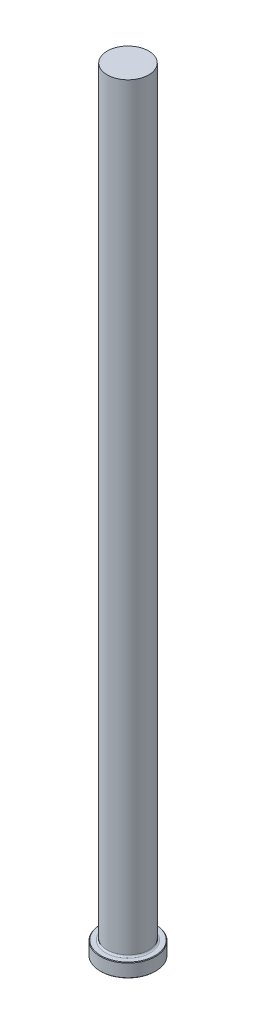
ISO-10303-21;
HEADER;
FILE_DESCRIPTION(('STEP AP214'),'2;1');
FILE_NAME('part.step','',(''),(''),'','','');
FILE_SCHEMA(('AUTOMOTIVE_DESIGN { 1 0 10303 214 1 1 1 1 }'));
ENDSEC;
DATA;
#1=APPLICATION_CONTEXT('core data for automotive mechanical design processes');
#2=APPLICATION_PROTOCOL_DEFINITION('international standard','automotive_design',2000,#1);
#3=PRODUCT_CONTEXT('',#1,'mechanical');
#4=PRODUCT('Part','Part','',(#3));
#5=PRODUCT_RELATED_PRODUCT_CATEGORY('part','',(#4));
#6=PRODUCT_DEFINITION_FORMATION('','',#4);
#7=PRODUCT_DEFINITION_CONTEXT('part definition',#1,'design');
#8=PRODUCT_DEFINITION('design','',#6,#7);
#9=PRODUCT_DEFINITION_SHAPE('','',#8);
#10=(LENGTH_UNIT() NAMED_UNIT(*) SI_UNIT(.MILLI.,.METRE.));
#11=(NAMED_UNIT(*) PLANE_ANGLE_UNIT() SI_UNIT($,.RADIAN.));
#12=(NAMED_UNIT(*) SI_UNIT($,.STERADIAN.) SOLID_ANGLE_UNIT());
#13=UNCERTAINTY_MEASURE_WITH_UNIT(LENGTH_MEASURE(1.E-05),#10,'distance_accuracy_value','');
#14=(GEOMETRIC_REPRESENTATION_CONTEXT(3) GLOBAL_UNCERTAINTY_ASSIGNED_CONTEXT((#13)) GLOBAL_UNIT_ASSIGNED_CONTEXT((#10,
#11,#12)) REPRESENTATION_CONTEXT('',''));
#15=CARTESIAN_POINT('',(0.,0.,0.));
#16=DIRECTION('',(0.,0.,1.));
#17=DIRECTION('',(1.,0.,0.));
#18=AXIS2_PLACEMENT_3D('',#15,#16,#17);
#19=CARTESIAN_POINT('',(0.,0.,0.));
#20=DIRECTION('',(0.,-1.,0.));
#21=DIRECTION('',(0.,0.,-1.));
#22=AXIS2_PLACEMENT_3D('',#19,#20,#21);
#23=PLANE('',#22);
#24=CARTESIAN_POINT('',(0.,0.,0.));
#25=DIRECTION('',(0.,-1.,0.));
#26=DIRECTION('',(0.,0.,-1.));
#27=AXIS2_PLACEMENT_3D('',#24,#25,#26);
#28=CIRCLE('',#27,12.446);
#29=CARTESIAN_POINT('',(0.,0.,-12.446));
#30=VERTEX_POINT('',#29);
#31=EDGE_CURVE('E46',#30,#30,#28,.T.);
#32=ORIENTED_EDGE('',*,*,#31,.T.);
#33=EDGE_LOOP('',(#32));
#34=FACE_BOUND('',#33,.T.);
#35=ADVANCED_FACE('F35',(#34),#23,.T.);
#36=CARTESIAN_POINT('',(0.,259.958771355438,0.));
#37=DIRECTION('',(0.,1.,0.));
#38=DIRECTION('',(0.,0.,1.));
#39=AXIS2_PLACEMENT_3D('',#36,#37,#38);
#40=CYLINDRICAL_SURFACE('',#39,12.7);
#41=CARTESIAN_POINT('',(0.,6.0960000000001,0.));
#42=DIRECTION('',(0.,1.,0.));
#43=DIRECTION('',(0.,0.,1.));
#44=AXIS2_PLACEMENT_3D('',#41,#42,#43);
#45=CIRCLE('',#44,12.7);
#46=CARTESIAN_POINT('',(0.,6.0960000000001,12.7));
#47=VERTEX_POINT('',#46);
#48=EDGE_CURVE('E50',#47,#47,#45,.F.);
#49=ORIENTED_EDGE('',*,*,#48,.T.);
#50=EDGE_LOOP('',(#49));
#51=FACE_BOUND('',#50,.T.);
#52=CARTESIAN_POINT('',(0.,0.253999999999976,0.));
#53=DIRECTION('',(0.,-1.,0.));
#54=DIRECTION('',(0.,0.,-1.));
#55=AXIS2_PLACEMENT_3D('',#52,#53,#54);
#56=CIRCLE('',#55,12.7);
#57=CARTESIAN_POINT('',(0.,0.253999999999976,-12.7));
#58=VERTEX_POINT('',#57);
#59=EDGE_CURVE('E55',#58,#58,#56,.F.);
#60=ORIENTED_EDGE('',*,*,#59,.T.);
#61=EDGE_LOOP('',(#60));
#62=FACE_BOUND('',#61,.T.);
#63=ADVANCED_FACE('F77',(#51,#62),#40,.T.);
#64=CARTESIAN_POINT('',(-12.7,6.35,0.));
#65=DIRECTION('',(0.,1.,0.));
#66=DIRECTION('',(0.,0.,1.));
#67=AXIS2_PLACEMENT_3D('',#64,#65,#66);
#68=PLANE('',#67);
#69=CARTESIAN_POINT('',(0.,6.35,0.));
#70=DIRECTION('',(0.,1.,0.));
#71=DIRECTION('',(0.,0.,1.));
#72=AXIS2_PLACEMENT_3D('',#69,#70,#71);
#73=CIRCLE('',#72,10.287);
#74=CARTESIAN_POINT('',(0.,6.35,10.287));
#75=VERTEX_POINT('',#74);
#76=EDGE_CURVE('E10',#75,#75,#73,.F.);
#77=ORIENTED_EDGE('',*,*,#76,.T.);
#78=EDGE_LOOP('',(#77));
#79=FACE_BOUND('',#78,.T.);
#80=CARTESIAN_POINT('',(0.,6.35,0.));
#81=DIRECTION('',(0.,1.,0.));
#82=DIRECTION('',(0.,0.,1.));
#83=AXIS2_PLACEMENT_3D('',#80,#81,#82);
#84=CIRCLE('',#83,12.4460000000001);
#85=CARTESIAN_POINT('',(0.,6.35,12.4460000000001));
#86=VERTEX_POINT('',#85);
#87=EDGE_CURVE('E58',#86,#86,#84,.T.);
#88=ORIENTED_EDGE('',*,*,#87,.T.);
#89=EDGE_LOOP('',(#88));
#90=FACE_BOUND('',#89,.T.);
#91=ADVANCED_FACE('F69',(#79,#90),#68,.T.);
#92=CARTESIAN_POINT('',(0.,259.958771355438,0.));
#93=DIRECTION('',(0.,1.,0.));
#94=DIRECTION('',(0.,0.,1.));
#95=AXIS2_PLACEMENT_3D('',#92,#93,#94);
#96=CYLINDRICAL_SURFACE('',#95,9.52499999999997);
#97=CARTESIAN_POINT('',(0.,7.11200000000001,0.));
#98=DIRECTION('',(0.,1.,0.));
#99=DIRECTION('',(0.,0.,1.));
#100=AXIS2_PLACEMENT_3D('',#97,#98,#99);
#101=CIRCLE('',#100,9.52499999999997);
#102=CARTESIAN_POINT('',(0.,7.11200000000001,9.52499999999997));
#103=VERTEX_POINT('',#102);
#104=EDGE_CURVE('E42',#103,#103,#101,.T.);
#105=ORIENTED_EDGE('',*,*,#104,.T.);
#106=EDGE_LOOP('',(#105));
#107=FACE_BOUND('',#106,.T.);
#108=CARTESIAN_POINT('',(0.,355.6,0.));
#109=DIRECTION('',(0.,1.,0.));
#110=DIRECTION('',(0.,0.,1.));
#111=AXIS2_PLACEMENT_3D('',#108,#109,#110);
#112=CIRCLE('',#111,9.52499999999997);
#113=CARTESIAN_POINT('',(0.,355.6,9.52499999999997));
#114=VERTEX_POINT('',#113);
#115=EDGE_CURVE('E61',#114,#114,#112,.T.);
#116=ORIENTED_EDGE('',*,*,#115,.F.);
#117=EDGE_LOOP('',(#116));
#118=FACE_BOUND('',#117,.T.);
#119=ADVANCED_FACE('F67',(#107,#118),#96,.T.);
#120=CARTESIAN_POINT('',(-9.52499999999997,355.6,0.));
#121=DIRECTION('',(0.,1.,0.));
#122=DIRECTION('',(0.,0.,1.));
#123=AXIS2_PLACEMENT_3D('',#120,#121,#122);
#124=PLANE('',#123);
#125=ORIENTED_EDGE('',*,*,#115,.T.);
#126=EDGE_LOOP('',(#125));
#127=FACE_BOUND('',#126,.T.);
#128=ADVANCED_FACE('F65',(#127),#124,.T.);
#129=CARTESIAN_POINT('',(0.,6.35000000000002,0.));
#130=DIRECTION('',(0.,-1.,0.));
#131=DIRECTION('',(0.,0.,-1.));
#132=AXIS2_PLACEMENT_3D('',#129,#130,#131);
#133=CONICAL_SURFACE('',#132,12.4460000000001,0.785398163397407);
#134=ORIENTED_EDGE('',*,*,#48,.F.);
#135=EDGE_LOOP('',(#134));
#136=FACE_BOUND('',#135,.T.);
#137=ORIENTED_EDGE('',*,*,#87,.F.);
#138=EDGE_LOOP('',(#137));
#139=FACE_BOUND('',#138,.T.);
#140=ADVANCED_FACE('F75',(#136,#139),#133,.T.);
#141=CARTESIAN_POINT('',(0.,0.253999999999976,0.));
#142=DIRECTION('',(0.,1.,0.));
#143=DIRECTION('',(0.,0.,1.));
#144=AXIS2_PLACEMENT_3D('',#141,#142,#143);
#145=CONICAL_SURFACE('',#144,12.7,0.785398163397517);
#146=ORIENTED_EDGE('',*,*,#31,.F.);
#147=EDGE_LOOP('',(#146));
#148=FACE_BOUND('',#147,.T.);
#149=ORIENTED_EDGE('',*,*,#59,.F.);
#150=EDGE_LOOP('',(#149));
#151=FACE_BOUND('',#150,.T.);
#152=ADVANCED_FACE('F89',(#148,#151),#145,.T.);
#153=CARTESIAN_POINT('',(0.,7.11200000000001,0.));
#154=DIRECTION('',(0.,1.,0.));
#155=DIRECTION('',(0.,0.,1.));
#156=AXIS2_PLACEMENT_3D('',#153,#154,#155);
#157=TOROIDAL_SURFACE('',#156,10.287,0.762);
#158=ORIENTED_EDGE('',*,*,#76,.F.);
#159=EDGE_LOOP('',(#158));
#160=FACE_BOUND('',#159,.T.);
#161=ORIENTED_EDGE('',*,*,#104,.F.);
#162=EDGE_LOOP('',(#161));
#163=FACE_BOUND('',#162,.T.);
#164=ADVANCED_FACE('F37',(#160,#163),#157,.F.);
#165=CLOSED_SHELL('',(#35,#63,#91,#119,#128,#140,#152,#164));
#166=MANIFOLD_SOLID_BREP('B2',#165);
#167=ADVANCED_BREP_SHAPE_REPRESENTATION('',(#18,#166),#14);
#168=SHAPE_DEFINITION_REPRESENTATION(#9,#167);
ENDSEC;
END-ISO-10303-21;
